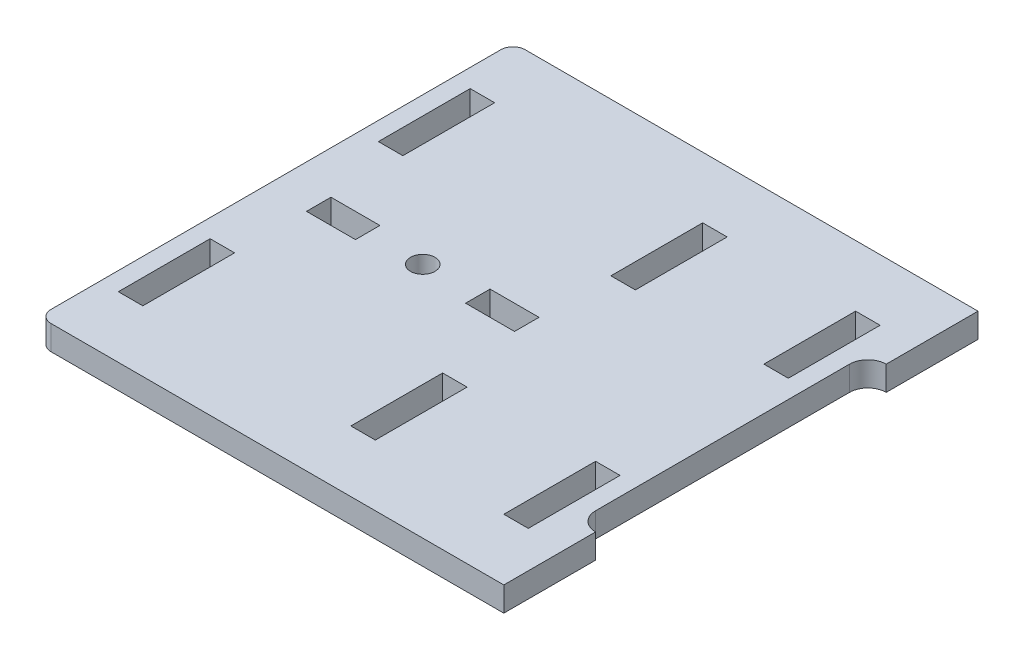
ISO-10303-21;
HEADER;
FILE_DESCRIPTION(('STEP AP214'),'2;1');
FILE_NAME('part.step','',(''),(''),'','','');
FILE_SCHEMA(('AUTOMOTIVE_DESIGN { 1 0 10303 214 1 1 1 1 }'));
ENDSEC;
DATA;
#1=APPLICATION_CONTEXT('core data for automotive mechanical design processes');
#2=APPLICATION_PROTOCOL_DEFINITION('international standard','automotive_design',2000,#1);
#3=PRODUCT_CONTEXT('',#1,'mechanical');
#4=PRODUCT('Part','Part','',(#3));
#5=PRODUCT_RELATED_PRODUCT_CATEGORY('part','',(#4));
#6=PRODUCT_DEFINITION_FORMATION('','',#4);
#7=PRODUCT_DEFINITION_CONTEXT('part definition',#1,'design');
#8=PRODUCT_DEFINITION('design','',#6,#7);
#9=PRODUCT_DEFINITION_SHAPE('','',#8);
#10=(LENGTH_UNIT() NAMED_UNIT(*) SI_UNIT(.MILLI.,.METRE.));
#11=(NAMED_UNIT(*) PLANE_ANGLE_UNIT() SI_UNIT($,.RADIAN.));
#12=(NAMED_UNIT(*) SI_UNIT($,.STERADIAN.) SOLID_ANGLE_UNIT());
#13=UNCERTAINTY_MEASURE_WITH_UNIT(LENGTH_MEASURE(1.E-05),#10,'distance_accuracy_value','');
#14=(GEOMETRIC_REPRESENTATION_CONTEXT(3) GLOBAL_UNCERTAINTY_ASSIGNED_CONTEXT((#13)) GLOBAL_UNIT_ASSIGNED_CONTEXT((#10,
#11,#12)) REPRESENTATION_CONTEXT('',''));
#15=CARTESIAN_POINT('',(0.,0.,0.));
#16=DIRECTION('',(0.,0.,1.));
#17=DIRECTION('',(1.,0.,0.));
#18=AXIS2_PLACEMENT_3D('',#15,#16,#17);
#19=CARTESIAN_POINT('',(38.,4.,20.75));
#20=DIRECTION('',(0.,-1.,0.));
#21=DIRECTION('',(0.,0.,-1.));
#22=AXIS2_PLACEMENT_3D('',#19,#20,#21);
#23=PLANE('',#22);
#24=CARTESIAN_POINT('',(-14.,4.,0.));
#25=DIRECTION('',(0.,1.,0.));
#26=DIRECTION('',(0.,0.,1.));
#27=AXIS2_PLACEMENT_3D('',#24,#25,#26);
#28=CIRCLE('',#27,2.);
#29=CARTESIAN_POINT('',(-14.,4.,2.));
#30=VERTEX_POINT('',#29);
#31=EDGE_CURVE('E338',#30,#30,#28,.T.);
#32=ORIENTED_EDGE('',*,*,#31,.F.);
#33=EDGE_LOOP('',(#32));
#34=FACE_BOUND('',#33,.T.);
#35=DIRECTION('',(1.,0.,0.));
#36=VECTOR('',#35,1.);
#37=CARTESIAN_POINT('',(-35.,4.,28.75));
#38=LINE('',#37,#36);
#39=CARTESIAN_POINT('',(-35.,4.,28.75));
#40=VERTEX_POINT('',#39);
#41=CARTESIAN_POINT('',(-31.,4.,28.75));
#42=VERTEX_POINT('',#41);
#43=EDGE_CURVE('E375',#40,#42,#38,.T.);
#44=ORIENTED_EDGE('',*,*,#43,.F.);
#45=DIRECTION('',(0.,0.,1.));
#46=VECTOR('',#45,1.);
#47=CARTESIAN_POINT('',(-35.,4.,28.75));
#48=LINE('',#47,#46);
#49=CARTESIAN_POINT('',(-35.,4.,13.75));
#50=VERTEX_POINT('',#49);
#51=EDGE_CURVE('E383',#50,#40,#48,.T.);
#52=ORIENTED_EDGE('',*,*,#51,.F.);
#53=DIRECTION('',(-1.,0.,0.));
#54=VECTOR('',#53,1.);
#55=CARTESIAN_POINT('',(-35.,4.,13.75));
#56=LINE('',#55,#54);
#57=CARTESIAN_POINT('',(-31.,4.,13.75));
#58=VERTEX_POINT('',#57);
#59=EDGE_CURVE('E380',#58,#50,#56,.T.);
#60=ORIENTED_EDGE('',*,*,#59,.F.);
#61=DIRECTION('',(0.,0.,-1.));
#62=VECTOR('',#61,1.);
#63=CARTESIAN_POINT('',(-31.,4.,28.75));
#64=LINE('',#63,#62);
#65=EDGE_CURVE('E377',#42,#58,#64,.T.);
#66=ORIENTED_EDGE('',*,*,#65,.F.);
#67=EDGE_LOOP('',(#44,#52,#60,#66));
#68=FACE_BOUND('',#67,.T.);
#69=DIRECTION('',(1.,0.,0.));
#70=VECTOR('',#69,1.);
#71=CARTESIAN_POINT('',(27.9999999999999,4.,28.75));
#72=LINE('',#71,#70);
#73=CARTESIAN_POINT('',(27.9999999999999,4.,28.75));
#74=VERTEX_POINT('',#73);
#75=CARTESIAN_POINT('',(31.9999999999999,4.,28.75));
#76=VERTEX_POINT('',#75);
#77=EDGE_CURVE('E437',#74,#76,#72,.T.);
#78=ORIENTED_EDGE('',*,*,#77,.F.);
#79=DIRECTION('',(0.,0.,1.));
#80=VECTOR('',#79,1.);
#81=CARTESIAN_POINT('',(27.9999999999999,4.,28.75));
#82=LINE('',#81,#80);
#83=CARTESIAN_POINT('',(28.,4.,13.75));
#84=VERTEX_POINT('',#83);
#85=EDGE_CURVE('E445',#84,#74,#82,.T.);
#86=ORIENTED_EDGE('',*,*,#85,.F.);
#87=DIRECTION('',(-1.,0.,0.));
#88=VECTOR('',#87,1.);
#89=CARTESIAN_POINT('',(28.,4.,13.75));
#90=LINE('',#89,#88);
#91=CARTESIAN_POINT('',(32.,4.,13.75));
#92=VERTEX_POINT('',#91);
#93=EDGE_CURVE('E442',#92,#84,#90,.T.);
#94=ORIENTED_EDGE('',*,*,#93,.F.);
#95=DIRECTION('',(0.,0.,-1.));
#96=VECTOR('',#95,1.);
#97=CARTESIAN_POINT('',(31.9999999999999,4.,28.75));
#98=LINE('',#97,#96);
#99=EDGE_CURVE('E439',#76,#92,#98,.T.);
#100=ORIENTED_EDGE('',*,*,#99,.F.);
#101=EDGE_LOOP('',(#78,#86,#94,#100));
#102=FACE_BOUND('',#101,.T.);
#103=DIRECTION('',(0.,0.,1.));
#104=VECTOR('',#103,1.);
#105=CARTESIAN_POINT('',(3.,4.,-28.75));
#106=LINE('',#105,#104);
#107=CARTESIAN_POINT('',(3.,4.,-28.75));
#108=VERTEX_POINT('',#107);
#109=CARTESIAN_POINT('',(3.,4.,-13.75));
#110=VERTEX_POINT('',#109);
#111=EDGE_CURVE('E499',#108,#110,#106,.T.);
#112=ORIENTED_EDGE('',*,*,#111,.F.);
#113=DIRECTION('',(-1.,0.,0.));
#114=VECTOR('',#113,1.);
#115=CARTESIAN_POINT('',(3.,4.,-28.75));
#116=LINE('',#115,#114);
#117=CARTESIAN_POINT('',(7.,4.,-28.75));
#118=VERTEX_POINT('',#117);
#119=EDGE_CURVE('E507',#118,#108,#116,.T.);
#120=ORIENTED_EDGE('',*,*,#119,.F.);
#121=DIRECTION('',(0.,0.,-1.));
#122=VECTOR('',#121,1.);
#123=CARTESIAN_POINT('',(7.,4.,-28.75));
#124=LINE('',#123,#122);
#125=CARTESIAN_POINT('',(7.,4.,-13.75));
#126=VERTEX_POINT('',#125);
#127=EDGE_CURVE('E504',#126,#118,#124,.T.);
#128=ORIENTED_EDGE('',*,*,#127,.F.);
#129=DIRECTION('',(1.,0.,0.));
#130=VECTOR('',#129,1.);
#131=CARTESIAN_POINT('',(3.,4.,-13.75));
#132=LINE('',#131,#130);
#133=EDGE_CURVE('E501',#110,#126,#132,.T.);
#134=ORIENTED_EDGE('',*,*,#133,.F.);
#135=EDGE_LOOP('',(#112,#120,#128,#134));
#136=FACE_BOUND('',#135,.T.);
#137=DIRECTION('',(0.,0.,-1.));
#138=VECTOR('',#137,1.);
#139=CARTESIAN_POINT('',(38.,4.,38.75));
#140=LINE('',#139,#138);
#141=CARTESIAN_POINT('',(38.,4.,38.75));
#142=VERTEX_POINT('',#141);
#143=CARTESIAN_POINT('',(38.,4.,23.75));
#144=VERTEX_POINT('',#143);
#145=EDGE_CURVE('E561',#142,#144,#140,.T.);
#146=ORIENTED_EDGE('',*,*,#145,.T.);
#147=CARTESIAN_POINT('',(38.,4.,20.75));
#148=DIRECTION('',(0.,-1.,0.));
#149=DIRECTION('',(0.,0.,-1.));
#150=AXIS2_PLACEMENT_3D('',#147,#148,#149);
#151=CIRCLE('',#150,3.);
#152=CARTESIAN_POINT('',(35.,4.,20.75));
#153=VERTEX_POINT('',#152);
#154=EDGE_CURVE('E564',#144,#153,#151,.T.);
#155=ORIENTED_EDGE('',*,*,#154,.T.);
#156=DIRECTION('',(0.,0.,-1.));
#157=VECTOR('',#156,1.);
#158=CARTESIAN_POINT('',(35.,4.,-20.75));
#159=LINE('',#158,#157);
#160=CARTESIAN_POINT('',(35.,4.,-20.75));
#161=VERTEX_POINT('',#160);
#162=EDGE_CURVE('E567',#153,#161,#159,.T.);
#163=ORIENTED_EDGE('',*,*,#162,.T.);
#164=CARTESIAN_POINT('',(38.,4.,-20.75));
#165=DIRECTION('',(0.,-1.,0.));
#166=DIRECTION('',(0.,0.,1.));
#167=AXIS2_PLACEMENT_3D('',#164,#165,#166);
#168=CIRCLE('',#167,3.);
#169=CARTESIAN_POINT('',(38.,4.,-23.75));
#170=VERTEX_POINT('',#169);
#171=EDGE_CURVE('E569',#161,#170,#168,.T.);
#172=ORIENTED_EDGE('',*,*,#171,.T.);
#173=DIRECTION('',(0.,0.,-1.));
#174=VECTOR('',#173,1.);
#175=CARTESIAN_POINT('',(38.,4.,-38.75));
#176=LINE('',#175,#174);
#177=CARTESIAN_POINT('',(38.,4.,-38.75));
#178=VERTEX_POINT('',#177);
#179=EDGE_CURVE('E571',#170,#178,#176,.T.);
#180=ORIENTED_EDGE('',*,*,#179,.T.);
#181=DIRECTION('',(-1.,0.,0.));
#182=VECTOR('',#181,1.);
#183=CARTESIAN_POINT('',(-36.,4.,-38.75));
#184=LINE('',#183,#182);
#185=CARTESIAN_POINT('',(-36.,4.,-38.75));
#186=VERTEX_POINT('',#185);
#187=EDGE_CURVE('E573',#178,#186,#184,.T.);
#188=ORIENTED_EDGE('',*,*,#187,.T.);
#189=CARTESIAN_POINT('',(-36.,4.,-36.75));
#190=DIRECTION('',(0.,1.,0.));
#191=DIRECTION('',(0.,0.,-1.));
#192=AXIS2_PLACEMENT_3D('',#189,#190,#191);
#193=CIRCLE('',#192,2.);
#194=CARTESIAN_POINT('',(-38.,4.,-36.75));
#195=VERTEX_POINT('',#194);
#196=EDGE_CURVE('E575',#186,#195,#193,.T.);
#197=ORIENTED_EDGE('',*,*,#196,.T.);
#198=DIRECTION('',(0.,0.,1.));
#199=VECTOR('',#198,1.);
#200=CARTESIAN_POINT('',(-38.,4.,-36.75));
#201=LINE('',#200,#199);
#202=CARTESIAN_POINT('',(-38.,4.,36.75));
#203=VERTEX_POINT('',#202);
#204=EDGE_CURVE('E577',#195,#203,#201,.T.);
#205=ORIENTED_EDGE('',*,*,#204,.T.);
#206=CARTESIAN_POINT('',(-36.,4.,36.75));
#207=DIRECTION('',(0.,1.,0.));
#208=DIRECTION('',(0.,0.,1.));
#209=AXIS2_PLACEMENT_3D('',#206,#207,#208);
#210=CIRCLE('',#209,2.);
#211=CARTESIAN_POINT('',(-36.,4.,38.75));
#212=VERTEX_POINT('',#211);
#213=EDGE_CURVE('E579',#203,#212,#210,.T.);
#214=ORIENTED_EDGE('',*,*,#213,.T.);
#215=DIRECTION('',(1.,0.,0.));
#216=VECTOR('',#215,1.);
#217=CARTESIAN_POINT('',(-36.,4.,38.75));
#218=LINE('',#217,#216);
#219=EDGE_CURVE('E581',#212,#142,#218,.T.);
#220=ORIENTED_EDGE('',*,*,#219,.T.);
#221=EDGE_LOOP('',(#146,#155,#163,#172,#180,#188,#197,#205,#214,#220));
#222=FACE_BOUND('',#221,.T.);
#223=DIRECTION('',(0.,0.,1.));
#224=VECTOR('',#223,1.);
#225=CARTESIAN_POINT('',(-35.,4.,-28.75));
#226=LINE('',#225,#224);
#227=CARTESIAN_POINT('',(-35.,4.,-28.75));
#228=VERTEX_POINT('',#227);
#229=CARTESIAN_POINT('',(-35.,4.,-13.75));
#230=VERTEX_POINT('',#229);
#231=EDGE_CURVE('E530',#228,#230,#226,.T.);
#232=ORIENTED_EDGE('',*,*,#231,.F.);
#233=DIRECTION('',(-1.,0.,0.));
#234=VECTOR('',#233,1.);
#235=CARTESIAN_POINT('',(-35.,4.,-28.75));
#236=LINE('',#235,#234);
#237=CARTESIAN_POINT('',(-31.,4.,-28.75));
#238=VERTEX_POINT('',#237);
#239=EDGE_CURVE('E538',#238,#228,#236,.T.);
#240=ORIENTED_EDGE('',*,*,#239,.F.);
#241=DIRECTION('',(0.,0.,-1.));
#242=VECTOR('',#241,1.);
#243=CARTESIAN_POINT('',(-31.,4.,-28.75));
#244=LINE('',#243,#242);
#245=CARTESIAN_POINT('',(-31.,4.,-13.75));
#246=VERTEX_POINT('',#245);
#247=EDGE_CURVE('E535',#246,#238,#244,.T.);
#248=ORIENTED_EDGE('',*,*,#247,.F.);
#249=DIRECTION('',(1.,0.,0.));
#250=VECTOR('',#249,1.);
#251=CARTESIAN_POINT('',(-35.,4.,-13.75));
#252=LINE('',#251,#250);
#253=EDGE_CURVE('E532',#230,#246,#252,.T.);
#254=ORIENTED_EDGE('',*,*,#253,.F.);
#255=EDGE_LOOP('',(#232,#240,#248,#254));
#256=FACE_BOUND('',#255,.T.);
#257=DIRECTION('',(0.,0.,1.));
#258=VECTOR('',#257,1.);
#259=CARTESIAN_POINT('',(28.,4.,-28.75));
#260=LINE('',#259,#258);
#261=CARTESIAN_POINT('',(28.,4.,-28.75));
#262=VERTEX_POINT('',#261);
#263=CARTESIAN_POINT('',(28.,4.,-13.75));
#264=VERTEX_POINT('',#263);
#265=EDGE_CURVE('E468',#262,#264,#260,.T.);
#266=ORIENTED_EDGE('',*,*,#265,.F.);
#267=DIRECTION('',(-1.,0.,0.));
#268=VECTOR('',#267,1.);
#269=CARTESIAN_POINT('',(28.,4.,-28.75));
#270=LINE('',#269,#268);
#271=CARTESIAN_POINT('',(32.,4.,-28.75));
#272=VERTEX_POINT('',#271);
#273=EDGE_CURVE('E476',#272,#262,#270,.T.);
#274=ORIENTED_EDGE('',*,*,#273,.F.);
#275=DIRECTION('',(0.,0.,-1.));
#276=VECTOR('',#275,1.);
#277=CARTESIAN_POINT('',(32.,4.,-28.75));
#278=LINE('',#277,#276);
#279=CARTESIAN_POINT('',(32.,4.,-13.75));
#280=VERTEX_POINT('',#279);
#281=EDGE_CURVE('E473',#280,#272,#278,.T.);
#282=ORIENTED_EDGE('',*,*,#281,.F.);
#283=DIRECTION('',(1.,0.,0.));
#284=VECTOR('',#283,1.);
#285=CARTESIAN_POINT('',(28.,4.,-13.75));
#286=LINE('',#285,#284);
#287=EDGE_CURVE('E470',#264,#280,#286,.T.);
#288=ORIENTED_EDGE('',*,*,#287,.F.);
#289=EDGE_LOOP('',(#266,#274,#282,#288));
#290=FACE_BOUND('',#289,.T.);
#291=DIRECTION('',(1.,0.,0.));
#292=VECTOR('',#291,1.);
#293=CARTESIAN_POINT('',(2.99999999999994,4.,28.75));
#294=LINE('',#293,#292);
#295=CARTESIAN_POINT('',(2.99999999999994,4.,28.75));
#296=VERTEX_POINT('',#295);
#297=CARTESIAN_POINT('',(6.99999999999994,4.,28.75));
#298=VERTEX_POINT('',#297);
#299=EDGE_CURVE('E406',#296,#298,#294,.T.);
#300=ORIENTED_EDGE('',*,*,#299,.F.);
#301=DIRECTION('',(0.,0.,1.));
#302=VECTOR('',#301,1.);
#303=CARTESIAN_POINT('',(2.99999999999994,4.,28.75));
#304=LINE('',#303,#302);
#305=CARTESIAN_POINT('',(3.,4.,13.75));
#306=VERTEX_POINT('',#305);
#307=EDGE_CURVE('E414',#306,#296,#304,.T.);
#308=ORIENTED_EDGE('',*,*,#307,.F.);
#309=DIRECTION('',(-1.,0.,0.));
#310=VECTOR('',#309,1.);
#311=CARTESIAN_POINT('',(3.,4.,13.75));
#312=LINE('',#311,#310);
#313=CARTESIAN_POINT('',(7.,4.,13.75));
#314=VERTEX_POINT('',#313);
#315=EDGE_CURVE('E411',#314,#306,#312,.T.);
#316=ORIENTED_EDGE('',*,*,#315,.F.);
#317=DIRECTION('',(0.,0.,-1.));
#318=VECTOR('',#317,1.);
#319=CARTESIAN_POINT('',(6.99999999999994,4.,28.75));
#320=LINE('',#319,#318);
#321=EDGE_CURVE('E408',#298,#314,#320,.T.);
#322=ORIENTED_EDGE('',*,*,#321,.F.);
#323=EDGE_LOOP('',(#300,#308,#316,#322));
#324=FACE_BOUND('',#323,.T.);
#325=DIRECTION('',(0.,0.,1.));
#326=VECTOR('',#325,1.);
#327=CARTESIAN_POINT('',(-31.,4.,-2.));
#328=LINE('',#327,#326);
#329=CARTESIAN_POINT('',(-31.,4.,-2.));
#330=VERTEX_POINT('',#329);
#331=CARTESIAN_POINT('',(-31.,4.,2.));
#332=VERTEX_POINT('',#331);
#333=EDGE_CURVE('E344',#330,#332,#328,.T.);
#334=ORIENTED_EDGE('',*,*,#333,.F.);
#335=DIRECTION('',(-1.,0.,0.));
#336=VECTOR('',#335,1.);
#337=CARTESIAN_POINT('',(-31.,4.,-2.));
#338=LINE('',#337,#336);
#339=CARTESIAN_POINT('',(-23.,4.,-2.));
#340=VERTEX_POINT('',#339);
#341=EDGE_CURVE('E352',#340,#330,#338,.T.);
#342=ORIENTED_EDGE('',*,*,#341,.F.);
#343=DIRECTION('',(0.,0.,-1.));
#344=VECTOR('',#343,1.);
#345=CARTESIAN_POINT('',(-23.,4.,-2.));
#346=LINE('',#345,#344);
#347=CARTESIAN_POINT('',(-23.,4.,2.));
#348=VERTEX_POINT('',#347);
#349=EDGE_CURVE('E349',#348,#340,#346,.T.);
#350=ORIENTED_EDGE('',*,*,#349,.F.);
#351=DIRECTION('',(1.,0.,0.));
#352=VECTOR('',#351,1.);
#353=CARTESIAN_POINT('',(-31.,4.,2.));
#354=LINE('',#353,#352);
#355=EDGE_CURVE('E346',#332,#348,#354,.T.);
#356=ORIENTED_EDGE('',*,*,#355,.F.);
#357=EDGE_LOOP('',(#334,#342,#350,#356));
#358=FACE_BOUND('',#357,.T.);
#359=DIRECTION('',(0.,0.,1.));
#360=VECTOR('',#359,1.);
#361=CARTESIAN_POINT('',(-4.99999999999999,4.,-2.));
#362=LINE('',#361,#360);
#363=CARTESIAN_POINT('',(-4.99999999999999,4.,-2.));
#364=VERTEX_POINT('',#363);
#365=CARTESIAN_POINT('',(-4.99999999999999,4.,2.));
#366=VERTEX_POINT('',#365);
#367=EDGE_CURVE('E302',#364,#366,#362,.T.);
#368=ORIENTED_EDGE('',*,*,#367,.F.);
#369=DIRECTION('',(-1.,0.,0.));
#370=VECTOR('',#369,1.);
#371=CARTESIAN_POINT('',(-4.99999999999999,4.,-2.));
#372=LINE('',#371,#370);
#373=CARTESIAN_POINT('',(3.00000000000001,4.,-2.));
#374=VERTEX_POINT('',#373);
#375=EDGE_CURVE('E324',#374,#364,#372,.T.);
#376=ORIENTED_EDGE('',*,*,#375,.F.);
#377=DIRECTION('',(0.,0.,-1.));
#378=VECTOR('',#377,1.);
#379=CARTESIAN_POINT('',(3.00000000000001,4.,-2.));
#380=LINE('',#379,#378);
#381=CARTESIAN_POINT('',(3.00000000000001,4.,2.));
#382=VERTEX_POINT('',#381);
#383=EDGE_CURVE('E322',#382,#374,#380,.T.);
#384=ORIENTED_EDGE('',*,*,#383,.F.);
#385=DIRECTION('',(1.,0.,0.));
#386=VECTOR('',#385,1.);
#387=CARTESIAN_POINT('',(-4.99999999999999,4.,2.));
#388=LINE('',#387,#386);
#389=EDGE_CURVE('E310',#366,#382,#388,.T.);
#390=ORIENTED_EDGE('',*,*,#389,.F.);
#391=EDGE_LOOP('',(#368,#376,#384,#390));
#392=FACE_BOUND('',#391,.T.);
#393=ADVANCED_FACE('F33',(#34,#68,#102,#136,#222,#256,#290,#324,#358,#392),#23,.F.);
#394=CARTESIAN_POINT('',(38.,0.,20.75));
#395=DIRECTION('',(0.,-1.,0.));
#396=DIRECTION('',(0.,0.,-1.));
#397=AXIS2_PLACEMENT_3D('',#394,#395,#396);
#398=PLANE('',#397);
#399=CARTESIAN_POINT('',(-14.,0.,0.));
#400=DIRECTION('',(0.,1.,0.));
#401=DIRECTION('',(0.,0.,1.));
#402=AXIS2_PLACEMENT_3D('',#399,#400,#401);
#403=CIRCLE('',#402,2.);
#404=CARTESIAN_POINT('',(-14.,0.,2.));
#405=VERTEX_POINT('',#404);
#406=EDGE_CURVE('E318',#405,#405,#403,.T.);
#407=ORIENTED_EDGE('',*,*,#406,.T.);
#408=EDGE_LOOP('',(#407));
#409=FACE_BOUND('',#408,.T.);
#410=DIRECTION('',(0.,0.,1.));
#411=VECTOR('',#410,1.);
#412=CARTESIAN_POINT('',(-35.,0.,28.75));
#413=LINE('',#412,#411);
#414=CARTESIAN_POINT('',(-35.,0.,13.75));
#415=VERTEX_POINT('',#414);
#416=CARTESIAN_POINT('',(-35.,0.,28.75));
#417=VERTEX_POINT('',#416);
#418=EDGE_CURVE('E378',#415,#417,#413,.T.);
#419=ORIENTED_EDGE('',*,*,#418,.T.);
#420=DIRECTION('',(1.,0.,0.));
#421=VECTOR('',#420,1.);
#422=CARTESIAN_POINT('',(-35.,0.,28.75));
#423=LINE('',#422,#421);
#424=CARTESIAN_POINT('',(-31.,0.,28.75));
#425=VERTEX_POINT('',#424);
#426=EDGE_CURVE('E374',#417,#425,#423,.T.);
#427=ORIENTED_EDGE('',*,*,#426,.T.);
#428=DIRECTION('',(0.,0.,-1.));
#429=VECTOR('',#428,1.);
#430=CARTESIAN_POINT('',(-31.,0.,28.75));
#431=LINE('',#430,#429);
#432=CARTESIAN_POINT('',(-31.,0.,13.75));
#433=VERTEX_POINT('',#432);
#434=EDGE_CURVE('E388',#425,#433,#431,.T.);
#435=ORIENTED_EDGE('',*,*,#434,.T.);
#436=DIRECTION('',(-1.,0.,0.));
#437=VECTOR('',#436,1.);
#438=CARTESIAN_POINT('',(-35.,0.,13.75));
#439=LINE('',#438,#437);
#440=EDGE_CURVE('E391',#433,#415,#439,.T.);
#441=ORIENTED_EDGE('',*,*,#440,.T.);
#442=EDGE_LOOP('',(#419,#427,#435,#441));
#443=FACE_BOUND('',#442,.T.);
#444=DIRECTION('',(0.,0.,1.));
#445=VECTOR('',#444,1.);
#446=CARTESIAN_POINT('',(27.9999999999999,0.,28.75));
#447=LINE('',#446,#445);
#448=CARTESIAN_POINT('',(28.,0.,13.75));
#449=VERTEX_POINT('',#448);
#450=CARTESIAN_POINT('',(27.9999999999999,0.,28.75));
#451=VERTEX_POINT('',#450);
#452=EDGE_CURVE('E440',#449,#451,#447,.T.);
#453=ORIENTED_EDGE('',*,*,#452,.T.);
#454=DIRECTION('',(1.,0.,0.));
#455=VECTOR('',#454,1.);
#456=CARTESIAN_POINT('',(27.9999999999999,0.,28.75));
#457=LINE('',#456,#455);
#458=CARTESIAN_POINT('',(31.9999999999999,0.,28.75));
#459=VERTEX_POINT('',#458);
#460=EDGE_CURVE('E436',#451,#459,#457,.T.);
#461=ORIENTED_EDGE('',*,*,#460,.T.);
#462=DIRECTION('',(0.,0.,-1.));
#463=VECTOR('',#462,1.);
#464=CARTESIAN_POINT('',(31.9999999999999,0.,28.75));
#465=LINE('',#464,#463);
#466=CARTESIAN_POINT('',(32.,0.,13.75));
#467=VERTEX_POINT('',#466);
#468=EDGE_CURVE('E450',#459,#467,#465,.T.);
#469=ORIENTED_EDGE('',*,*,#468,.T.);
#470=DIRECTION('',(-1.,0.,0.));
#471=VECTOR('',#470,1.);
#472=CARTESIAN_POINT('',(28.,0.,13.75));
#473=LINE('',#472,#471);
#474=EDGE_CURVE('E453',#467,#449,#473,.T.);
#475=ORIENTED_EDGE('',*,*,#474,.T.);
#476=EDGE_LOOP('',(#453,#461,#469,#475));
#477=FACE_BOUND('',#476,.T.);
#478=DIRECTION('',(-1.,0.,0.));
#479=VECTOR('',#478,1.);
#480=CARTESIAN_POINT('',(3.,0.,-28.75));
#481=LINE('',#480,#479);
#482=CARTESIAN_POINT('',(7.,0.,-28.75));
#483=VERTEX_POINT('',#482);
#484=CARTESIAN_POINT('',(3.,0.,-28.75));
#485=VERTEX_POINT('',#484);
#486=EDGE_CURVE('E502',#483,#485,#481,.T.);
#487=ORIENTED_EDGE('',*,*,#486,.T.);
#488=DIRECTION('',(0.,0.,1.));
#489=VECTOR('',#488,1.);
#490=CARTESIAN_POINT('',(3.,0.,-28.75));
#491=LINE('',#490,#489);
#492=CARTESIAN_POINT('',(3.,0.,-13.75));
#493=VERTEX_POINT('',#492);
#494=EDGE_CURVE('E498',#485,#493,#491,.T.);
#495=ORIENTED_EDGE('',*,*,#494,.T.);
#496=DIRECTION('',(1.,0.,0.));
#497=VECTOR('',#496,1.);
#498=CARTESIAN_POINT('',(3.,0.,-13.75));
#499=LINE('',#498,#497);
#500=CARTESIAN_POINT('',(7.,0.,-13.75));
#501=VERTEX_POINT('',#500);
#502=EDGE_CURVE('E512',#493,#501,#499,.T.);
#503=ORIENTED_EDGE('',*,*,#502,.T.);
#504=DIRECTION('',(0.,0.,-1.));
#505=VECTOR('',#504,1.);
#506=CARTESIAN_POINT('',(7.,0.,-28.75));
#507=LINE('',#506,#505);
#508=EDGE_CURVE('E515',#501,#483,#507,.T.);
#509=ORIENTED_EDGE('',*,*,#508,.T.);
#510=EDGE_LOOP('',(#487,#495,#503,#509));
#511=FACE_BOUND('',#510,.T.);
#512=DIRECTION('',(0.,0.,-1.));
#513=VECTOR('',#512,1.);
#514=CARTESIAN_POINT('',(38.,0.,38.75));
#515=LINE('',#514,#513);
#516=CARTESIAN_POINT('',(38.,0.,38.75));
#517=VERTEX_POINT('',#516);
#518=CARTESIAN_POINT('',(38.,0.,23.75));
#519=VERTEX_POINT('',#518);
#520=EDGE_CURVE('E560',#517,#519,#515,.T.);
#521=ORIENTED_EDGE('',*,*,#520,.F.);
#522=DIRECTION('',(1.,0.,0.));
#523=VECTOR('',#522,1.);
#524=CARTESIAN_POINT('',(-36.,0.,38.75));
#525=LINE('',#524,#523);
#526=CARTESIAN_POINT('',(-36.,0.,38.75));
#527=VERTEX_POINT('',#526);
#528=EDGE_CURVE('E565',#527,#517,#525,.T.);
#529=ORIENTED_EDGE('',*,*,#528,.F.);
#530=CARTESIAN_POINT('',(-36.,0.,36.75));
#531=DIRECTION('',(0.,1.,0.));
#532=DIRECTION('',(0.,0.,1.));
#533=AXIS2_PLACEMENT_3D('',#530,#531,#532);
#534=CIRCLE('',#533,2.);
#535=CARTESIAN_POINT('',(-38.,0.,36.75));
#536=VERTEX_POINT('',#535);
#537=EDGE_CURVE('E600',#536,#527,#534,.T.);
#538=ORIENTED_EDGE('',*,*,#537,.F.);
#539=DIRECTION('',(0.,0.,1.));
#540=VECTOR('',#539,1.);
#541=CARTESIAN_POINT('',(-38.,0.,-36.75));
#542=LINE('',#541,#540);
#543=CARTESIAN_POINT('',(-38.,0.,-36.75));
#544=VERTEX_POINT('',#543);
#545=EDGE_CURVE('E598',#544,#536,#542,.T.);
#546=ORIENTED_EDGE('',*,*,#545,.F.);
#547=CARTESIAN_POINT('',(-36.,0.,-36.75));
#548=DIRECTION('',(0.,1.,0.));
#549=DIRECTION('',(0.,0.,-1.));
#550=AXIS2_PLACEMENT_3D('',#547,#548,#549);
#551=CIRCLE('',#550,2.);
#552=CARTESIAN_POINT('',(-36.,0.,-38.75));
#553=VERTEX_POINT('',#552);
#554=EDGE_CURVE('E596',#553,#544,#551,.T.);
#555=ORIENTED_EDGE('',*,*,#554,.F.);
#556=DIRECTION('',(-1.,0.,0.));
#557=VECTOR('',#556,1.);
#558=CARTESIAN_POINT('',(-36.,0.,-38.75));
#559=LINE('',#558,#557);
#560=CARTESIAN_POINT('',(38.,0.,-38.75));
#561=VERTEX_POINT('',#560);
#562=EDGE_CURVE('E594',#561,#553,#559,.T.);
#563=ORIENTED_EDGE('',*,*,#562,.F.);
#564=DIRECTION('',(0.,0.,-1.));
#565=VECTOR('',#564,1.);
#566=CARTESIAN_POINT('',(38.,0.,-38.75));
#567=LINE('',#566,#565);
#568=CARTESIAN_POINT('',(38.,0.,-23.75));
#569=VERTEX_POINT('',#568);
#570=EDGE_CURVE('E592',#569,#561,#567,.T.);
#571=ORIENTED_EDGE('',*,*,#570,.F.);
#572=CARTESIAN_POINT('',(38.,0.,-20.75));
#573=DIRECTION('',(0.,-1.,0.));
#574=DIRECTION('',(0.,0.,1.));
#575=AXIS2_PLACEMENT_3D('',#572,#573,#574);
#576=CIRCLE('',#575,3.);
#577=CARTESIAN_POINT('',(35.,0.,-20.75));
#578=VERTEX_POINT('',#577);
#579=EDGE_CURVE('E590',#578,#569,#576,.T.);
#580=ORIENTED_EDGE('',*,*,#579,.F.);
#581=DIRECTION('',(0.,0.,-1.));
#582=VECTOR('',#581,1.);
#583=CARTESIAN_POINT('',(35.,0.,-20.75));
#584=LINE('',#583,#582);
#585=CARTESIAN_POINT('',(35.,0.,20.75));
#586=VERTEX_POINT('',#585);
#587=EDGE_CURVE('E588',#586,#578,#584,.T.);
#588=ORIENTED_EDGE('',*,*,#587,.F.);
#589=CARTESIAN_POINT('',(38.,0.,20.75));
#590=DIRECTION('',(0.,-1.,0.));
#591=DIRECTION('',(0.,0.,-1.));
#592=AXIS2_PLACEMENT_3D('',#589,#590,#591);
#593=CIRCLE('',#592,3.);
#594=EDGE_CURVE('E586',#519,#586,#593,.T.);
#595=ORIENTED_EDGE('',*,*,#594,.F.);
#596=EDGE_LOOP('',(#521,#529,#538,#546,#555,#563,#571,#580,#588,#595));
#597=FACE_BOUND('',#596,.T.);
#598=DIRECTION('',(-1.,0.,0.));
#599=VECTOR('',#598,1.);
#600=CARTESIAN_POINT('',(-35.,0.,-28.75));
#601=LINE('',#600,#599);
#602=CARTESIAN_POINT('',(-31.,0.,-28.75));
#603=VERTEX_POINT('',#602);
#604=CARTESIAN_POINT('',(-35.,0.,-28.75));
#605=VERTEX_POINT('',#604);
#606=EDGE_CURVE('E533',#603,#605,#601,.T.);
#607=ORIENTED_EDGE('',*,*,#606,.T.);
#608=DIRECTION('',(0.,0.,1.));
#609=VECTOR('',#608,1.);
#610=CARTESIAN_POINT('',(-35.,0.,-28.75));
#611=LINE('',#610,#609);
#612=CARTESIAN_POINT('',(-35.,0.,-13.75));
#613=VERTEX_POINT('',#612);
#614=EDGE_CURVE('E529',#605,#613,#611,.T.);
#615=ORIENTED_EDGE('',*,*,#614,.T.);
#616=DIRECTION('',(1.,0.,0.));
#617=VECTOR('',#616,1.);
#618=CARTESIAN_POINT('',(-35.,0.,-13.75));
#619=LINE('',#618,#617);
#620=CARTESIAN_POINT('',(-31.,0.,-13.75));
#621=VERTEX_POINT('',#620);
#622=EDGE_CURVE('E543',#613,#621,#619,.T.);
#623=ORIENTED_EDGE('',*,*,#622,.T.);
#624=DIRECTION('',(0.,0.,-1.));
#625=VECTOR('',#624,1.);
#626=CARTESIAN_POINT('',(-31.,0.,-28.75));
#627=LINE('',#626,#625);
#628=EDGE_CURVE('E546',#621,#603,#627,.T.);
#629=ORIENTED_EDGE('',*,*,#628,.T.);
#630=EDGE_LOOP('',(#607,#615,#623,#629));
#631=FACE_BOUND('',#630,.T.);
#632=DIRECTION('',(-1.,0.,0.));
#633=VECTOR('',#632,1.);
#634=CARTESIAN_POINT('',(28.,0.,-28.75));
#635=LINE('',#634,#633);
#636=CARTESIAN_POINT('',(32.,0.,-28.75));
#637=VERTEX_POINT('',#636);
#638=CARTESIAN_POINT('',(28.,0.,-28.75));
#639=VERTEX_POINT('',#638);
#640=EDGE_CURVE('E471',#637,#639,#635,.T.);
#641=ORIENTED_EDGE('',*,*,#640,.T.);
#642=DIRECTION('',(0.,0.,1.));
#643=VECTOR('',#642,1.);
#644=CARTESIAN_POINT('',(28.,0.,-28.75));
#645=LINE('',#644,#643);
#646=CARTESIAN_POINT('',(28.,0.,-13.75));
#647=VERTEX_POINT('',#646);
#648=EDGE_CURVE('E467',#639,#647,#645,.T.);
#649=ORIENTED_EDGE('',*,*,#648,.T.);
#650=DIRECTION('',(1.,0.,0.));
#651=VECTOR('',#650,1.);
#652=CARTESIAN_POINT('',(28.,0.,-13.75));
#653=LINE('',#652,#651);
#654=CARTESIAN_POINT('',(32.,0.,-13.75));
#655=VERTEX_POINT('',#654);
#656=EDGE_CURVE('E481',#647,#655,#653,.T.);
#657=ORIENTED_EDGE('',*,*,#656,.T.);
#658=DIRECTION('',(0.,0.,-1.));
#659=VECTOR('',#658,1.);
#660=CARTESIAN_POINT('',(32.,0.,-28.75));
#661=LINE('',#660,#659);
#662=EDGE_CURVE('E484',#655,#637,#661,.T.);
#663=ORIENTED_EDGE('',*,*,#662,.T.);
#664=EDGE_LOOP('',(#641,#649,#657,#663));
#665=FACE_BOUND('',#664,.T.);
#666=DIRECTION('',(0.,0.,1.));
#667=VECTOR('',#666,1.);
#668=CARTESIAN_POINT('',(2.99999999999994,0.,28.75));
#669=LINE('',#668,#667);
#670=CARTESIAN_POINT('',(3.,0.,13.75));
#671=VERTEX_POINT('',#670);
#672=CARTESIAN_POINT('',(2.99999999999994,0.,28.75));
#673=VERTEX_POINT('',#672);
#674=EDGE_CURVE('E409',#671,#673,#669,.T.);
#675=ORIENTED_EDGE('',*,*,#674,.T.);
#676=DIRECTION('',(1.,0.,0.));
#677=VECTOR('',#676,1.);
#678=CARTESIAN_POINT('',(2.99999999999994,0.,28.75));
#679=LINE('',#678,#677);
#680=CARTESIAN_POINT('',(6.99999999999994,0.,28.75));
#681=VERTEX_POINT('',#680);
#682=EDGE_CURVE('E405',#673,#681,#679,.T.);
#683=ORIENTED_EDGE('',*,*,#682,.T.);
#684=DIRECTION('',(0.,0.,-1.));
#685=VECTOR('',#684,1.);
#686=CARTESIAN_POINT('',(6.99999999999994,0.,28.75));
#687=LINE('',#686,#685);
#688=CARTESIAN_POINT('',(7.,0.,13.75));
#689=VERTEX_POINT('',#688);
#690=EDGE_CURVE('E419',#681,#689,#687,.T.);
#691=ORIENTED_EDGE('',*,*,#690,.T.);
#692=DIRECTION('',(-1.,0.,0.));
#693=VECTOR('',#692,1.);
#694=CARTESIAN_POINT('',(3.,0.,13.75));
#695=LINE('',#694,#693);
#696=EDGE_CURVE('E422',#689,#671,#695,.T.);
#697=ORIENTED_EDGE('',*,*,#696,.T.);
#698=EDGE_LOOP('',(#675,#683,#691,#697));
#699=FACE_BOUND('',#698,.T.);
#700=DIRECTION('',(-1.,0.,0.));
#701=VECTOR('',#700,1.);
#702=CARTESIAN_POINT('',(-31.,0.,-2.));
#703=LINE('',#702,#701);
#704=CARTESIAN_POINT('',(-23.,0.,-2.));
#705=VERTEX_POINT('',#704);
#706=CARTESIAN_POINT('',(-31.,0.,-2.));
#707=VERTEX_POINT('',#706);
#708=EDGE_CURVE('E347',#705,#707,#703,.T.);
#709=ORIENTED_EDGE('',*,*,#708,.T.);
#710=DIRECTION('',(0.,0.,1.));
#711=VECTOR('',#710,1.);
#712=CARTESIAN_POINT('',(-31.,0.,-2.));
#713=LINE('',#712,#711);
#714=CARTESIAN_POINT('',(-31.,0.,2.));
#715=VERTEX_POINT('',#714);
#716=EDGE_CURVE('E341',#707,#715,#713,.T.);
#717=ORIENTED_EDGE('',*,*,#716,.T.);
#718=DIRECTION('',(1.,0.,0.));
#719=VECTOR('',#718,1.);
#720=CARTESIAN_POINT('',(-31.,0.,2.));
#721=LINE('',#720,#719);
#722=CARTESIAN_POINT('',(-23.,0.,2.));
#723=VERTEX_POINT('',#722);
#724=EDGE_CURVE('E357',#715,#723,#721,.T.);
#725=ORIENTED_EDGE('',*,*,#724,.T.);
#726=DIRECTION('',(0.,0.,-1.));
#727=VECTOR('',#726,1.);
#728=CARTESIAN_POINT('',(-23.,0.,-2.));
#729=LINE('',#728,#727);
#730=EDGE_CURVE('E360',#723,#705,#729,.T.);
#731=ORIENTED_EDGE('',*,*,#730,.T.);
#732=EDGE_LOOP('',(#709,#717,#725,#731));
#733=FACE_BOUND('',#732,.T.);
#734=DIRECTION('',(-1.,0.,0.));
#735=VECTOR('',#734,1.);
#736=CARTESIAN_POINT('',(-4.99999999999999,0.,-2.));
#737=LINE('',#736,#735);
#738=CARTESIAN_POINT('',(3.00000000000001,0.,-2.));
#739=VERTEX_POINT('',#738);
#740=CARTESIAN_POINT('',(-4.99999999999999,0.,-2.));
#741=VERTEX_POINT('',#740);
#742=EDGE_CURVE('E311',#739,#741,#737,.T.);
#743=ORIENTED_EDGE('',*,*,#742,.T.);
#744=DIRECTION('',(0.,0.,1.));
#745=VECTOR('',#744,1.);
#746=CARTESIAN_POINT('',(-4.99999999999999,0.,-2.));
#747=LINE('',#746,#745);
#748=CARTESIAN_POINT('',(-4.99999999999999,0.,2.));
#749=VERTEX_POINT('',#748);
#750=EDGE_CURVE('E56',#741,#749,#747,.T.);
#751=ORIENTED_EDGE('',*,*,#750,.T.);
#752=DIRECTION('',(1.,0.,0.));
#753=VECTOR('',#752,1.);
#754=CARTESIAN_POINT('',(-4.99999999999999,0.,2.));
#755=LINE('',#754,#753);
#756=CARTESIAN_POINT('',(3.00000000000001,0.,2.));
#757=VERTEX_POINT('',#756);
#758=EDGE_CURVE('E317',#749,#757,#755,.T.);
#759=ORIENTED_EDGE('',*,*,#758,.T.);
#760=DIRECTION('',(0.,0.,-1.));
#761=VECTOR('',#760,1.);
#762=CARTESIAN_POINT('',(3.00000000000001,0.,-2.));
#763=LINE('',#762,#761);
#764=EDGE_CURVE('E330',#757,#739,#763,.T.);
#765=ORIENTED_EDGE('',*,*,#764,.T.);
#766=EDGE_LOOP('',(#743,#751,#759,#765));
#767=FACE_BOUND('',#766,.T.);
#768=ADVANCED_FACE('F636',(#409,#443,#477,#511,#597,#631,#665,#699,#733,#767),#398,.T.);
#769=CARTESIAN_POINT('',(38.,4.,38.75));
#770=DIRECTION('',(-1.,0.,0.));
#771=DIRECTION('',(0.,0.,1.));
#772=AXIS2_PLACEMENT_3D('',#769,#770,#771);
#773=PLANE('',#772);
#774=ORIENTED_EDGE('',*,*,#520,.T.);
#775=DIRECTION('',(0.,-1.,0.));
#776=VECTOR('',#775,1.);
#777=CARTESIAN_POINT('',(38.,4.,23.75));
#778=LINE('',#777,#776);
#779=EDGE_CURVE('E11',#144,#519,#778,.T.);
#780=ORIENTED_EDGE('',*,*,#779,.F.);
#781=ORIENTED_EDGE('',*,*,#145,.F.);
#782=DIRECTION('',(0.,-1.,0.));
#783=VECTOR('',#782,1.);
#784=CARTESIAN_POINT('',(38.,4.,38.75));
#785=LINE('',#784,#783);
#786=EDGE_CURVE('E583',#142,#517,#785,.T.);
#787=ORIENTED_EDGE('',*,*,#786,.T.);
#788=EDGE_LOOP('',(#774,#780,#781,#787));
#789=FACE_BOUND('',#788,.T.);
#790=ADVANCED_FACE('F35',(#789),#773,.F.);
#791=CARTESIAN_POINT('',(38.,4.,20.75));
#792=DIRECTION('',(0.,-1.,0.));
#793=DIRECTION('',(0.,0.,-1.));
#794=AXIS2_PLACEMENT_3D('',#791,#792,#793);
#795=CYLINDRICAL_SURFACE('',#794,3.);
#796=ORIENTED_EDGE('',*,*,#594,.T.);
#797=DIRECTION('',(0.,-1.,0.));
#798=VECTOR('',#797,1.);
#799=CARTESIAN_POINT('',(35.,4.,20.75));
#800=LINE('',#799,#798);
#801=EDGE_CURVE('E41',#153,#586,#800,.T.);
#802=ORIENTED_EDGE('',*,*,#801,.F.);
#803=ORIENTED_EDGE('',*,*,#154,.F.);
#804=ORIENTED_EDGE('',*,*,#779,.T.);
#805=EDGE_LOOP('',(#796,#802,#803,#804));
#806=FACE_BOUND('',#805,.T.);
#807=ADVANCED_FACE('F654',(#806),#795,.F.);
#808=CARTESIAN_POINT('',(35.,4.,-20.75));
#809=DIRECTION('',(-1.,0.,0.));
#810=DIRECTION('',(0.,0.,1.));
#811=AXIS2_PLACEMENT_3D('',#808,#809,#810);
#812=PLANE('',#811);
#813=ORIENTED_EDGE('',*,*,#587,.T.);
#814=DIRECTION('',(0.,-1.,0.));
#815=VECTOR('',#814,1.);
#816=CARTESIAN_POINT('',(35.,4.,-20.75));
#817=LINE('',#816,#815);
#818=EDGE_CURVE('E623',#161,#578,#817,.T.);
#819=ORIENTED_EDGE('',*,*,#818,.F.);
#820=ORIENTED_EDGE('',*,*,#162,.F.);
#821=ORIENTED_EDGE('',*,*,#801,.T.);
#822=EDGE_LOOP('',(#813,#819,#820,#821));
#823=FACE_BOUND('',#822,.T.);
#824=ADVANCED_FACE('F630',(#823),#812,.F.);
#825=CARTESIAN_POINT('',(38.,4.,-20.75));
#826=DIRECTION('',(0.,-1.,0.));
#827=DIRECTION('',(0.,0.,-1.));
#828=AXIS2_PLACEMENT_3D('',#825,#826,#827);
#829=CYLINDRICAL_SURFACE('',#828,3.);
#830=ORIENTED_EDGE('',*,*,#579,.T.);
#831=DIRECTION('',(0.,-1.,0.));
#832=VECTOR('',#831,1.);
#833=CARTESIAN_POINT('',(38.,4.,-23.75));
#834=LINE('',#833,#832);
#835=EDGE_CURVE('E620',#170,#569,#834,.T.);
#836=ORIENTED_EDGE('',*,*,#835,.F.);
#837=ORIENTED_EDGE('',*,*,#171,.F.);
#838=ORIENTED_EDGE('',*,*,#818,.T.);
#839=EDGE_LOOP('',(#830,#836,#837,#838));
#840=FACE_BOUND('',#839,.T.);
#841=ADVANCED_FACE('F642',(#840),#829,.F.);
#842=CARTESIAN_POINT('',(38.,4.,-38.75));
#843=DIRECTION('',(-1.,0.,0.));
#844=DIRECTION('',(0.,0.,1.));
#845=AXIS2_PLACEMENT_3D('',#842,#843,#844);
#846=PLANE('',#845);
#847=ORIENTED_EDGE('',*,*,#570,.T.);
#848=DIRECTION('',(0.,-1.,0.));
#849=VECTOR('',#848,1.);
#850=CARTESIAN_POINT('',(38.,4.,-38.75));
#851=LINE('',#850,#849);
#852=EDGE_CURVE('E617',#178,#561,#851,.T.);
#853=ORIENTED_EDGE('',*,*,#852,.F.);
#854=ORIENTED_EDGE('',*,*,#179,.F.);
#855=ORIENTED_EDGE('',*,*,#835,.T.);
#856=EDGE_LOOP('',(#847,#853,#854,#855));
#857=FACE_BOUND('',#856,.T.);
#858=ADVANCED_FACE('F646',(#857),#846,.F.);
#859=CARTESIAN_POINT('',(-36.,4.,-38.75));
#860=DIRECTION('',(0.,0.,1.));
#861=DIRECTION('',(1.,0.,0.));
#862=AXIS2_PLACEMENT_3D('',#859,#860,#861);
#863=PLANE('',#862);
#864=ORIENTED_EDGE('',*,*,#562,.T.);
#865=DIRECTION('',(0.,-1.,0.));
#866=VECTOR('',#865,1.);
#867=CARTESIAN_POINT('',(-36.,4.,-38.75));
#868=LINE('',#867,#866);
#869=EDGE_CURVE('E614',#186,#553,#868,.T.);
#870=ORIENTED_EDGE('',*,*,#869,.F.);
#871=ORIENTED_EDGE('',*,*,#187,.F.);
#872=ORIENTED_EDGE('',*,*,#852,.T.);
#873=EDGE_LOOP('',(#864,#870,#871,#872));
#874=FACE_BOUND('',#873,.T.);
#875=ADVANCED_FACE('F677',(#874),#863,.F.);
#876=CARTESIAN_POINT('',(-36.,4.,-36.75));
#877=DIRECTION('',(0.,-1.,0.));
#878=DIRECTION('',(0.,0.,-1.));
#879=AXIS2_PLACEMENT_3D('',#876,#877,#878);
#880=CYLINDRICAL_SURFACE('',#879,2.);
#881=ORIENTED_EDGE('',*,*,#554,.T.);
#882=DIRECTION('',(0.,-1.,0.));
#883=VECTOR('',#882,1.);
#884=CARTESIAN_POINT('',(-38.,4.,-36.75));
#885=LINE('',#884,#883);
#886=EDGE_CURVE('E611',#195,#544,#885,.T.);
#887=ORIENTED_EDGE('',*,*,#886,.F.);
#888=ORIENTED_EDGE('',*,*,#196,.F.);
#889=ORIENTED_EDGE('',*,*,#869,.T.);
#890=EDGE_LOOP('',(#881,#887,#888,#889));
#891=FACE_BOUND('',#890,.T.);
#892=ADVANCED_FACE('F674',(#891),#880,.T.);
#893=CARTESIAN_POINT('',(-38.,4.,-36.75));
#894=DIRECTION('',(1.,0.,0.));
#895=DIRECTION('',(0.,0.,-1.));
#896=AXIS2_PLACEMENT_3D('',#893,#894,#895);
#897=PLANE('',#896);
#898=ORIENTED_EDGE('',*,*,#545,.T.);
#899=DIRECTION('',(0.,-1.,0.));
#900=VECTOR('',#899,1.);
#901=CARTESIAN_POINT('',(-38.,4.,36.75));
#902=LINE('',#901,#900);
#903=EDGE_CURVE('E608',#203,#536,#902,.T.);
#904=ORIENTED_EDGE('',*,*,#903,.F.);
#905=ORIENTED_EDGE('',*,*,#204,.F.);
#906=ORIENTED_EDGE('',*,*,#886,.T.);
#907=EDGE_LOOP('',(#898,#904,#905,#906));
#908=FACE_BOUND('',#907,.T.);
#909=ADVANCED_FACE('F670',(#908),#897,.F.);
#910=CARTESIAN_POINT('',(-36.,4.,36.75));
#911=DIRECTION('',(0.,-1.,0.));
#912=DIRECTION('',(0.,0.,-1.));
#913=AXIS2_PLACEMENT_3D('',#910,#911,#912);
#914=CYLINDRICAL_SURFACE('',#913,2.);
#915=ORIENTED_EDGE('',*,*,#537,.T.);
#916=DIRECTION('',(0.,-1.,0.));
#917=VECTOR('',#916,1.);
#918=CARTESIAN_POINT('',(-36.,4.,38.75));
#919=LINE('',#918,#917);
#920=EDGE_CURVE('E605',#212,#527,#919,.T.);
#921=ORIENTED_EDGE('',*,*,#920,.F.);
#922=ORIENTED_EDGE('',*,*,#213,.F.);
#923=ORIENTED_EDGE('',*,*,#903,.T.);
#924=EDGE_LOOP('',(#915,#921,#922,#923));
#925=FACE_BOUND('',#924,.T.);
#926=ADVANCED_FACE('F666',(#925),#914,.T.);
#927=CARTESIAN_POINT('',(-36.,4.,38.75));
#928=DIRECTION('',(0.,0.,-1.));
#929=DIRECTION('',(-1.,0.,0.));
#930=AXIS2_PLACEMENT_3D('',#927,#928,#929);
#931=PLANE('',#930);
#932=ORIENTED_EDGE('',*,*,#528,.T.);
#933=ORIENTED_EDGE('',*,*,#786,.F.);
#934=ORIENTED_EDGE('',*,*,#219,.F.);
#935=ORIENTED_EDGE('',*,*,#920,.T.);
#936=EDGE_LOOP('',(#932,#933,#934,#935));
#937=FACE_BOUND('',#936,.T.);
#938=ADVANCED_FACE('F661',(#937),#931,.F.);
#939=CARTESIAN_POINT('',(-35.,4.,-28.75));
#940=DIRECTION('',(1.,0.,0.));
#941=DIRECTION('',(0.,0.,-1.));
#942=AXIS2_PLACEMENT_3D('',#939,#940,#941);
#943=PLANE('',#942);
#944=ORIENTED_EDGE('',*,*,#614,.F.);
#945=DIRECTION('',(0.,-1.,0.));
#946=VECTOR('',#945,1.);
#947=CARTESIAN_POINT('',(-35.,4.,-28.75));
#948=LINE('',#947,#946);
#949=EDGE_CURVE('E540',#228,#605,#948,.T.);
#950=ORIENTED_EDGE('',*,*,#949,.F.);
#951=ORIENTED_EDGE('',*,*,#231,.T.);
#952=DIRECTION('',(0.,-1.,0.));
#953=VECTOR('',#952,1.);
#954=CARTESIAN_POINT('',(-35.,4.,-13.75));
#955=LINE('',#954,#953);
#956=EDGE_CURVE('E557',#230,#613,#955,.T.);
#957=ORIENTED_EDGE('',*,*,#956,.T.);
#958=EDGE_LOOP('',(#944,#950,#951,#957));
#959=FACE_BOUND('',#958,.T.);
#960=ADVANCED_FACE('F697',(#959),#943,.T.);
#961=CARTESIAN_POINT('',(-35.,4.,-13.75));
#962=DIRECTION('',(0.,0.,-1.));
#963=DIRECTION('',(-1.,0.,0.));
#964=AXIS2_PLACEMENT_3D('',#961,#962,#963);
#965=PLANE('',#964);
#966=ORIENTED_EDGE('',*,*,#622,.F.);
#967=ORIENTED_EDGE('',*,*,#956,.F.);
#968=ORIENTED_EDGE('',*,*,#253,.T.);
#969=DIRECTION('',(0.,-1.,0.));
#970=VECTOR('',#969,1.);
#971=CARTESIAN_POINT('',(-31.,4.,-13.75));
#972=LINE('',#971,#970);
#973=EDGE_CURVE('E555',#246,#621,#972,.T.);
#974=ORIENTED_EDGE('',*,*,#973,.T.);
#975=EDGE_LOOP('',(#966,#967,#968,#974));
#976=FACE_BOUND('',#975,.T.);
#977=ADVANCED_FACE('F723',(#976),#965,.T.);
#978=CARTESIAN_POINT('',(-31.,4.,-28.75));
#979=DIRECTION('',(-1.,0.,0.));
#980=DIRECTION('',(0.,0.,1.));
#981=AXIS2_PLACEMENT_3D('',#978,#979,#980);
#982=PLANE('',#981);
#983=ORIENTED_EDGE('',*,*,#628,.F.);
#984=ORIENTED_EDGE('',*,*,#973,.F.);
#985=ORIENTED_EDGE('',*,*,#247,.T.);
#986=DIRECTION('',(0.,-1.,0.));
#987=VECTOR('',#986,1.);
#988=CARTESIAN_POINT('',(-31.,4.,-28.75));
#989=LINE('',#988,#987);
#990=EDGE_CURVE('E553',#238,#603,#989,.T.);
#991=ORIENTED_EDGE('',*,*,#990,.T.);
#992=EDGE_LOOP('',(#983,#984,#985,#991));
#993=FACE_BOUND('',#992,.T.);
#994=ADVANCED_FACE('F730',(#993),#982,.T.);
#995=CARTESIAN_POINT('',(-35.,4.,-28.75));
#996=DIRECTION('',(0.,0.,1.));
#997=DIRECTION('',(1.,0.,0.));
#998=AXIS2_PLACEMENT_3D('',#995,#996,#997);
#999=PLANE('',#998);
#1000=ORIENTED_EDGE('',*,*,#606,.F.);
#1001=ORIENTED_EDGE('',*,*,#990,.F.);
#1002=ORIENTED_EDGE('',*,*,#239,.T.);
#1003=ORIENTED_EDGE('',*,*,#949,.T.);
#1004=EDGE_LOOP('',(#1000,#1001,#1002,#1003));
#1005=FACE_BOUND('',#1004,.T.);
#1006=ADVANCED_FACE('F737',(#1005),#999,.T.);
#1007=CARTESIAN_POINT('',(3.,4.,-28.75));
#1008=DIRECTION('',(1.,0.,0.));
#1009=DIRECTION('',(0.,0.,-1.));
#1010=AXIS2_PLACEMENT_3D('',#1007,#1008,#1009);
#1011=PLANE('',#1010);
#1012=ORIENTED_EDGE('',*,*,#494,.F.);
#1013=DIRECTION('',(0.,-1.,0.));
#1014=VECTOR('',#1013,1.);
#1015=CARTESIAN_POINT('',(3.,4.,-28.75));
#1016=LINE('',#1015,#1014);
#1017=EDGE_CURVE('E509',#108,#485,#1016,.T.);
#1018=ORIENTED_EDGE('',*,*,#1017,.F.);
#1019=ORIENTED_EDGE('',*,*,#111,.T.);
#1020=DIRECTION('',(0.,-1.,0.));
#1021=VECTOR('',#1020,1.);
#1022=CARTESIAN_POINT('',(3.,4.,-13.75));
#1023=LINE('',#1022,#1021);
#1024=EDGE_CURVE('E526',#110,#493,#1023,.T.);
#1025=ORIENTED_EDGE('',*,*,#1024,.T.);
#1026=EDGE_LOOP('',(#1012,#1018,#1019,#1025));
#1027=FACE_BOUND('',#1026,.T.);
#1028=ADVANCED_FACE('F745',(#1027),#1011,.T.);
#1029=CARTESIAN_POINT('',(3.,4.,-13.75));
#1030=DIRECTION('',(0.,0.,-1.));
#1031=DIRECTION('',(-1.,0.,0.));
#1032=AXIS2_PLACEMENT_3D('',#1029,#1030,#1031);
#1033=PLANE('',#1032);
#1034=ORIENTED_EDGE('',*,*,#502,.F.);
#1035=ORIENTED_EDGE('',*,*,#1024,.F.);
#1036=ORIENTED_EDGE('',*,*,#133,.T.);
#1037=DIRECTION('',(0.,-1.,0.));
#1038=VECTOR('',#1037,1.);
#1039=CARTESIAN_POINT('',(7.,4.,-13.75));
#1040=LINE('',#1039,#1038);
#1041=EDGE_CURVE('E524',#126,#501,#1040,.T.);
#1042=ORIENTED_EDGE('',*,*,#1041,.T.);
#1043=EDGE_LOOP('',(#1034,#1035,#1036,#1042));
#1044=FACE_BOUND('',#1043,.T.);
#1045=ADVANCED_FACE('F753',(#1044),#1033,.T.);
#1046=CARTESIAN_POINT('',(7.,4.,-28.75));
#1047=DIRECTION('',(-1.,0.,0.));
#1048=DIRECTION('',(0.,0.,1.));
#1049=AXIS2_PLACEMENT_3D('',#1046,#1047,#1048);
#1050=PLANE('',#1049);
#1051=ORIENTED_EDGE('',*,*,#508,.F.);
#1052=ORIENTED_EDGE('',*,*,#1041,.F.);
#1053=ORIENTED_EDGE('',*,*,#127,.T.);
#1054=DIRECTION('',(0.,-1.,0.));
#1055=VECTOR('',#1054,1.);
#1056=CARTESIAN_POINT('',(7.,4.,-28.75));
#1057=LINE('',#1056,#1055);
#1058=EDGE_CURVE('E522',#118,#483,#1057,.T.);
#1059=ORIENTED_EDGE('',*,*,#1058,.T.);
#1060=EDGE_LOOP('',(#1051,#1052,#1053,#1059));
#1061=FACE_BOUND('',#1060,.T.);
#1062=ADVANCED_FACE('F761',(#1061),#1050,.T.);
#1063=CARTESIAN_POINT('',(3.,4.,-28.75));
#1064=DIRECTION('',(0.,0.,1.));
#1065=DIRECTION('',(1.,0.,0.));
#1066=AXIS2_PLACEMENT_3D('',#1063,#1064,#1065);
#1067=PLANE('',#1066);
#1068=ORIENTED_EDGE('',*,*,#486,.F.);
#1069=ORIENTED_EDGE('',*,*,#1058,.F.);
#1070=ORIENTED_EDGE('',*,*,#119,.T.);
#1071=ORIENTED_EDGE('',*,*,#1017,.T.);
#1072=EDGE_LOOP('',(#1068,#1069,#1070,#1071));
#1073=FACE_BOUND('',#1072,.T.);
#1074=ADVANCED_FACE('F769',(#1073),#1067,.T.);
#1075=CARTESIAN_POINT('',(28.,4.,-28.75));
#1076=DIRECTION('',(1.,0.,0.));
#1077=DIRECTION('',(0.,0.,-1.));
#1078=AXIS2_PLACEMENT_3D('',#1075,#1076,#1077);
#1079=PLANE('',#1078);
#1080=ORIENTED_EDGE('',*,*,#648,.F.);
#1081=DIRECTION('',(0.,-1.,0.));
#1082=VECTOR('',#1081,1.);
#1083=CARTESIAN_POINT('',(28.,4.,-28.75));
#1084=LINE('',#1083,#1082);
#1085=EDGE_CURVE('E478',#262,#639,#1084,.T.);
#1086=ORIENTED_EDGE('',*,*,#1085,.F.);
#1087=ORIENTED_EDGE('',*,*,#265,.T.);
#1088=DIRECTION('',(0.,-1.,0.));
#1089=VECTOR('',#1088,1.);
#1090=CARTESIAN_POINT('',(28.,4.,-13.75));
#1091=LINE('',#1090,#1089);
#1092=EDGE_CURVE('E495',#264,#647,#1091,.T.);
#1093=ORIENTED_EDGE('',*,*,#1092,.T.);
#1094=EDGE_LOOP('',(#1080,#1086,#1087,#1093));
#1095=FACE_BOUND('',#1094,.T.);
#1096=ADVANCED_FACE('F777',(#1095),#1079,.T.);
#1097=CARTESIAN_POINT('',(28.,4.,-13.75));
#1098=DIRECTION('',(0.,0.,-1.));
#1099=DIRECTION('',(-1.,0.,0.));
#1100=AXIS2_PLACEMENT_3D('',#1097,#1098,#1099);
#1101=PLANE('',#1100);
#1102=ORIENTED_EDGE('',*,*,#656,.F.);
#1103=ORIENTED_EDGE('',*,*,#1092,.F.);
#1104=ORIENTED_EDGE('',*,*,#287,.T.);
#1105=DIRECTION('',(0.,-1.,0.));
#1106=VECTOR('',#1105,1.);
#1107=CARTESIAN_POINT('',(32.,4.,-13.75));
#1108=LINE('',#1107,#1106);
#1109=EDGE_CURVE('E493',#280,#655,#1108,.T.);
#1110=ORIENTED_EDGE('',*,*,#1109,.T.);
#1111=EDGE_LOOP('',(#1102,#1103,#1104,#1110));
#1112=FACE_BOUND('',#1111,.T.);
#1113=ADVANCED_FACE('F785',(#1112),#1101,.T.);
#1114=CARTESIAN_POINT('',(32.,4.,-28.75));
#1115=DIRECTION('',(-1.,0.,0.));
#1116=DIRECTION('',(0.,0.,1.));
#1117=AXIS2_PLACEMENT_3D('',#1114,#1115,#1116);
#1118=PLANE('',#1117);
#1119=ORIENTED_EDGE('',*,*,#662,.F.);
#1120=ORIENTED_EDGE('',*,*,#1109,.F.);
#1121=ORIENTED_EDGE('',*,*,#281,.T.);
#1122=DIRECTION('',(0.,-1.,0.));
#1123=VECTOR('',#1122,1.);
#1124=CARTESIAN_POINT('',(32.,4.,-28.75));
#1125=LINE('',#1124,#1123);
#1126=EDGE_CURVE('E491',#272,#637,#1125,.T.);
#1127=ORIENTED_EDGE('',*,*,#1126,.T.);
#1128=EDGE_LOOP('',(#1119,#1120,#1121,#1127));
#1129=FACE_BOUND('',#1128,.T.);
#1130=ADVANCED_FACE('F793',(#1129),#1118,.T.);
#1131=CARTESIAN_POINT('',(28.,4.,-28.75));
#1132=DIRECTION('',(0.,0.,1.));
#1133=DIRECTION('',(1.,0.,0.));
#1134=AXIS2_PLACEMENT_3D('',#1131,#1132,#1133);
#1135=PLANE('',#1134);
#1136=ORIENTED_EDGE('',*,*,#640,.F.);
#1137=ORIENTED_EDGE('',*,*,#1126,.F.);
#1138=ORIENTED_EDGE('',*,*,#273,.T.);
#1139=ORIENTED_EDGE('',*,*,#1085,.T.);
#1140=EDGE_LOOP('',(#1136,#1137,#1138,#1139));
#1141=FACE_BOUND('',#1140,.T.);
#1142=ADVANCED_FACE('F801',(#1141),#1135,.T.);
#1143=CARTESIAN_POINT('',(27.9999999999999,4.,28.75));
#1144=DIRECTION('',(0.,0.,-1.));
#1145=DIRECTION('',(-1.,0.,0.));
#1146=AXIS2_PLACEMENT_3D('',#1143,#1144,#1145);
#1147=PLANE('',#1146);
#1148=ORIENTED_EDGE('',*,*,#460,.F.);
#1149=DIRECTION('',(0.,-1.,0.));
#1150=VECTOR('',#1149,1.);
#1151=CARTESIAN_POINT('',(27.9999999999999,4.,28.75));
#1152=LINE('',#1151,#1150);
#1153=EDGE_CURVE('E447',#74,#451,#1152,.T.);
#1154=ORIENTED_EDGE('',*,*,#1153,.F.);
#1155=ORIENTED_EDGE('',*,*,#77,.T.);
#1156=DIRECTION('',(0.,-1.,0.));
#1157=VECTOR('',#1156,1.);
#1158=CARTESIAN_POINT('',(31.9999999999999,4.,28.75));
#1159=LINE('',#1158,#1157);
#1160=EDGE_CURVE('E464',#76,#459,#1159,.T.);
#1161=ORIENTED_EDGE('',*,*,#1160,.T.);
#1162=EDGE_LOOP('',(#1148,#1154,#1155,#1161));
#1163=FACE_BOUND('',#1162,.T.);
#1164=ADVANCED_FACE('F809',(#1163),#1147,.T.);
#1165=CARTESIAN_POINT('',(31.9999999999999,4.,28.75));
#1166=DIRECTION('',(-1.,0.,0.));
#1167=DIRECTION('',(0.,0.,1.));
#1168=AXIS2_PLACEMENT_3D('',#1165,#1166,#1167);
#1169=PLANE('',#1168);
#1170=ORIENTED_EDGE('',*,*,#468,.F.);
#1171=ORIENTED_EDGE('',*,*,#1160,.F.);
#1172=ORIENTED_EDGE('',*,*,#99,.T.);
#1173=DIRECTION('',(0.,-1.,0.));
#1174=VECTOR('',#1173,1.);
#1175=CARTESIAN_POINT('',(32.,4.,13.75));
#1176=LINE('',#1175,#1174);
#1177=EDGE_CURVE('E462',#92,#467,#1176,.T.);
#1178=ORIENTED_EDGE('',*,*,#1177,.T.);
#1179=EDGE_LOOP('',(#1170,#1171,#1172,#1178));
#1180=FACE_BOUND('',#1179,.T.);
#1181=ADVANCED_FACE('F817',(#1180),#1169,.T.);
#1182=CARTESIAN_POINT('',(28.,4.,13.75));
#1183=DIRECTION('',(0.,0.,1.));
#1184=DIRECTION('',(1.,0.,0.));
#1185=AXIS2_PLACEMENT_3D('',#1182,#1183,#1184);
#1186=PLANE('',#1185);
#1187=ORIENTED_EDGE('',*,*,#474,.F.);
#1188=ORIENTED_EDGE('',*,*,#1177,.F.);
#1189=ORIENTED_EDGE('',*,*,#93,.T.);
#1190=DIRECTION('',(0.,-1.,0.));
#1191=VECTOR('',#1190,1.);
#1192=CARTESIAN_POINT('',(28.,4.,13.75));
#1193=LINE('',#1192,#1191);
#1194=EDGE_CURVE('E460',#84,#449,#1193,.T.);
#1195=ORIENTED_EDGE('',*,*,#1194,.T.);
#1196=EDGE_LOOP('',(#1187,#1188,#1189,#1195));
#1197=FACE_BOUND('',#1196,.T.);
#1198=ADVANCED_FACE('F825',(#1197),#1186,.T.);
#1199=CARTESIAN_POINT('',(27.9999999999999,4.,28.75));
#1200=DIRECTION('',(1.,0.,0.));
#1201=DIRECTION('',(0.,0.,-1.));
#1202=AXIS2_PLACEMENT_3D('',#1199,#1200,#1201);
#1203=PLANE('',#1202);
#1204=ORIENTED_EDGE('',*,*,#452,.F.);
#1205=ORIENTED_EDGE('',*,*,#1194,.F.);
#1206=ORIENTED_EDGE('',*,*,#85,.T.);
#1207=ORIENTED_EDGE('',*,*,#1153,.T.);
#1208=EDGE_LOOP('',(#1204,#1205,#1206,#1207));
#1209=FACE_BOUND('',#1208,.T.);
#1210=ADVANCED_FACE('F833',(#1209),#1203,.T.);
#1211=CARTESIAN_POINT('',(2.99999999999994,4.,28.75));
#1212=DIRECTION('',(0.,0.,-1.));
#1213=DIRECTION('',(-1.,0.,0.));
#1214=AXIS2_PLACEMENT_3D('',#1211,#1212,#1213);
#1215=PLANE('',#1214);
#1216=ORIENTED_EDGE('',*,*,#682,.F.);
#1217=DIRECTION('',(0.,-1.,0.));
#1218=VECTOR('',#1217,1.);
#1219=CARTESIAN_POINT('',(2.99999999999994,4.,28.75));
#1220=LINE('',#1219,#1218);
#1221=EDGE_CURVE('E416',#296,#673,#1220,.T.);
#1222=ORIENTED_EDGE('',*,*,#1221,.F.);
#1223=ORIENTED_EDGE('',*,*,#299,.T.);
#1224=DIRECTION('',(0.,-1.,0.));
#1225=VECTOR('',#1224,1.);
#1226=CARTESIAN_POINT('',(6.99999999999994,4.,28.75));
#1227=LINE('',#1226,#1225);
#1228=EDGE_CURVE('E433',#298,#681,#1227,.T.);
#1229=ORIENTED_EDGE('',*,*,#1228,.T.);
#1230=EDGE_LOOP('',(#1216,#1222,#1223,#1229));
#1231=FACE_BOUND('',#1230,.T.);
#1232=ADVANCED_FACE('F841',(#1231),#1215,.T.);
#1233=CARTESIAN_POINT('',(6.99999999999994,4.,28.75));
#1234=DIRECTION('',(-1.,0.,0.));
#1235=DIRECTION('',(0.,0.,1.));
#1236=AXIS2_PLACEMENT_3D('',#1233,#1234,#1235);
#1237=PLANE('',#1236);
#1238=ORIENTED_EDGE('',*,*,#690,.F.);
#1239=ORIENTED_EDGE('',*,*,#1228,.F.);
#1240=ORIENTED_EDGE('',*,*,#321,.T.);
#1241=DIRECTION('',(0.,-1.,0.));
#1242=VECTOR('',#1241,1.);
#1243=CARTESIAN_POINT('',(7.,4.,13.75));
#1244=LINE('',#1243,#1242);
#1245=EDGE_CURVE('E431',#314,#689,#1244,.T.);
#1246=ORIENTED_EDGE('',*,*,#1245,.T.);
#1247=EDGE_LOOP('',(#1238,#1239,#1240,#1246));
#1248=FACE_BOUND('',#1247,.T.);
#1249=ADVANCED_FACE('F849',(#1248),#1237,.T.);
#1250=CARTESIAN_POINT('',(3.,4.,13.75));
#1251=DIRECTION('',(0.,0.,1.));
#1252=DIRECTION('',(1.,0.,0.));
#1253=AXIS2_PLACEMENT_3D('',#1250,#1251,#1252);
#1254=PLANE('',#1253);
#1255=ORIENTED_EDGE('',*,*,#696,.F.);
#1256=ORIENTED_EDGE('',*,*,#1245,.F.);
#1257=ORIENTED_EDGE('',*,*,#315,.T.);
#1258=DIRECTION('',(0.,-1.,0.));
#1259=VECTOR('',#1258,1.);
#1260=CARTESIAN_POINT('',(3.,4.,13.75));
#1261=LINE('',#1260,#1259);
#1262=EDGE_CURVE('E429',#306,#671,#1261,.T.);
#1263=ORIENTED_EDGE('',*,*,#1262,.T.);
#1264=EDGE_LOOP('',(#1255,#1256,#1257,#1263));
#1265=FACE_BOUND('',#1264,.T.);
#1266=ADVANCED_FACE('F857',(#1265),#1254,.T.);
#1267=CARTESIAN_POINT('',(2.99999999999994,4.,28.75));
#1268=DIRECTION('',(1.,0.,0.));
#1269=DIRECTION('',(0.,0.,-1.));
#1270=AXIS2_PLACEMENT_3D('',#1267,#1268,#1269);
#1271=PLANE('',#1270);
#1272=ORIENTED_EDGE('',*,*,#674,.F.);
#1273=ORIENTED_EDGE('',*,*,#1262,.F.);
#1274=ORIENTED_EDGE('',*,*,#307,.T.);
#1275=ORIENTED_EDGE('',*,*,#1221,.T.);
#1276=EDGE_LOOP('',(#1272,#1273,#1274,#1275));
#1277=FACE_BOUND('',#1276,.T.);
#1278=ADVANCED_FACE('F865',(#1277),#1271,.T.);
#1279=CARTESIAN_POINT('',(-35.,4.,28.75));
#1280=DIRECTION('',(0.,0.,-1.));
#1281=DIRECTION('',(-1.,0.,0.));
#1282=AXIS2_PLACEMENT_3D('',#1279,#1280,#1281);
#1283=PLANE('',#1282);
#1284=ORIENTED_EDGE('',*,*,#426,.F.);
#1285=DIRECTION('',(0.,-1.,0.));
#1286=VECTOR('',#1285,1.);
#1287=CARTESIAN_POINT('',(-35.,4.,28.75));
#1288=LINE('',#1287,#1286);
#1289=EDGE_CURVE('E385',#40,#417,#1288,.T.);
#1290=ORIENTED_EDGE('',*,*,#1289,.F.);
#1291=ORIENTED_EDGE('',*,*,#43,.T.);
#1292=DIRECTION('',(0.,-1.,0.));
#1293=VECTOR('',#1292,1.);
#1294=CARTESIAN_POINT('',(-31.,4.,28.75));
#1295=LINE('',#1294,#1293);
#1296=EDGE_CURVE('E402',#42,#425,#1295,.T.);
#1297=ORIENTED_EDGE('',*,*,#1296,.T.);
#1298=EDGE_LOOP('',(#1284,#1290,#1291,#1297));
#1299=FACE_BOUND('',#1298,.T.);
#1300=ADVANCED_FACE('F873',(#1299),#1283,.T.);
#1301=CARTESIAN_POINT('',(-31.,4.,28.75));
#1302=DIRECTION('',(-1.,0.,0.));
#1303=DIRECTION('',(0.,0.,1.));
#1304=AXIS2_PLACEMENT_3D('',#1301,#1302,#1303);
#1305=PLANE('',#1304);
#1306=ORIENTED_EDGE('',*,*,#434,.F.);
#1307=ORIENTED_EDGE('',*,*,#1296,.F.);
#1308=ORIENTED_EDGE('',*,*,#65,.T.);
#1309=DIRECTION('',(0.,-1.,0.));
#1310=VECTOR('',#1309,1.);
#1311=CARTESIAN_POINT('',(-31.,4.,13.75));
#1312=LINE('',#1311,#1310);
#1313=EDGE_CURVE('E400',#58,#433,#1312,.T.);
#1314=ORIENTED_EDGE('',*,*,#1313,.T.);
#1315=EDGE_LOOP('',(#1306,#1307,#1308,#1314));
#1316=FACE_BOUND('',#1315,.T.);
#1317=ADVANCED_FACE('F881',(#1316),#1305,.T.);
#1318=CARTESIAN_POINT('',(-35.,4.,13.75));
#1319=DIRECTION('',(0.,0.,1.));
#1320=DIRECTION('',(1.,0.,0.));
#1321=AXIS2_PLACEMENT_3D('',#1318,#1319,#1320);
#1322=PLANE('',#1321);
#1323=ORIENTED_EDGE('',*,*,#440,.F.);
#1324=ORIENTED_EDGE('',*,*,#1313,.F.);
#1325=ORIENTED_EDGE('',*,*,#59,.T.);
#1326=DIRECTION('',(0.,-1.,0.));
#1327=VECTOR('',#1326,1.);
#1328=CARTESIAN_POINT('',(-35.,4.,13.75));
#1329=LINE('',#1328,#1327);
#1330=EDGE_CURVE('E398',#50,#415,#1329,.T.);
#1331=ORIENTED_EDGE('',*,*,#1330,.T.);
#1332=EDGE_LOOP('',(#1323,#1324,#1325,#1331));
#1333=FACE_BOUND('',#1332,.T.);
#1334=ADVANCED_FACE('F889',(#1333),#1322,.T.);
#1335=CARTESIAN_POINT('',(-35.,4.,28.75));
#1336=DIRECTION('',(1.,0.,0.));
#1337=DIRECTION('',(0.,0.,-1.));
#1338=AXIS2_PLACEMENT_3D('',#1335,#1336,#1337);
#1339=PLANE('',#1338);
#1340=ORIENTED_EDGE('',*,*,#418,.F.);
#1341=ORIENTED_EDGE('',*,*,#1330,.F.);
#1342=ORIENTED_EDGE('',*,*,#51,.T.);
#1343=ORIENTED_EDGE('',*,*,#1289,.T.);
#1344=EDGE_LOOP('',(#1340,#1341,#1342,#1343));
#1345=FACE_BOUND('',#1344,.T.);
#1346=ADVANCED_FACE('F897',(#1345),#1339,.T.);
#1347=CARTESIAN_POINT('',(-31.,4.,-2.));
#1348=DIRECTION('',(1.,0.,0.));
#1349=DIRECTION('',(0.,0.,-1.));
#1350=AXIS2_PLACEMENT_3D('',#1347,#1348,#1349);
#1351=PLANE('',#1350);
#1352=ORIENTED_EDGE('',*,*,#716,.F.);
#1353=DIRECTION('',(0.,-1.,0.));
#1354=VECTOR('',#1353,1.);
#1355=CARTESIAN_POINT('',(-31.,4.,-2.));
#1356=LINE('',#1355,#1354);
#1357=EDGE_CURVE('E354',#330,#707,#1356,.T.);
#1358=ORIENTED_EDGE('',*,*,#1357,.F.);
#1359=ORIENTED_EDGE('',*,*,#333,.T.);
#1360=DIRECTION('',(0.,-1.,0.));
#1361=VECTOR('',#1360,1.);
#1362=CARTESIAN_POINT('',(-31.,4.,2.));
#1363=LINE('',#1362,#1361);
#1364=EDGE_CURVE('E371',#332,#715,#1363,.T.);
#1365=ORIENTED_EDGE('',*,*,#1364,.T.);
#1366=EDGE_LOOP('',(#1352,#1358,#1359,#1365));
#1367=FACE_BOUND('',#1366,.T.);
#1368=ADVANCED_FACE('F905',(#1367),#1351,.T.);
#1369=CARTESIAN_POINT('',(-31.,4.,2.));
#1370=DIRECTION('',(0.,0.,-1.));
#1371=DIRECTION('',(-1.,0.,0.));
#1372=AXIS2_PLACEMENT_3D('',#1369,#1370,#1371);
#1373=PLANE('',#1372);
#1374=ORIENTED_EDGE('',*,*,#724,.F.);
#1375=ORIENTED_EDGE('',*,*,#1364,.F.);
#1376=ORIENTED_EDGE('',*,*,#355,.T.);
#1377=DIRECTION('',(0.,-1.,0.));
#1378=VECTOR('',#1377,1.);
#1379=CARTESIAN_POINT('',(-23.,4.,2.));
#1380=LINE('',#1379,#1378);
#1381=EDGE_CURVE('E369',#348,#723,#1380,.T.);
#1382=ORIENTED_EDGE('',*,*,#1381,.T.);
#1383=EDGE_LOOP('',(#1374,#1375,#1376,#1382));
#1384=FACE_BOUND('',#1383,.T.);
#1385=ADVANCED_FACE('F913',(#1384),#1373,.T.);
#1386=CARTESIAN_POINT('',(-23.,4.,-2.));
#1387=DIRECTION('',(-1.,0.,0.));
#1388=DIRECTION('',(0.,0.,1.));
#1389=AXIS2_PLACEMENT_3D('',#1386,#1387,#1388);
#1390=PLANE('',#1389);
#1391=ORIENTED_EDGE('',*,*,#730,.F.);
#1392=ORIENTED_EDGE('',*,*,#1381,.F.);
#1393=ORIENTED_EDGE('',*,*,#349,.T.);
#1394=DIRECTION('',(0.,-1.,0.));
#1395=VECTOR('',#1394,1.);
#1396=CARTESIAN_POINT('',(-23.,4.,-2.));
#1397=LINE('',#1396,#1395);
#1398=EDGE_CURVE('E367',#340,#705,#1397,.T.);
#1399=ORIENTED_EDGE('',*,*,#1398,.T.);
#1400=EDGE_LOOP('',(#1391,#1392,#1393,#1399));
#1401=FACE_BOUND('',#1400,.T.);
#1402=ADVANCED_FACE('F921',(#1401),#1390,.T.);
#1403=CARTESIAN_POINT('',(-31.,4.,-2.));
#1404=DIRECTION('',(0.,0.,1.));
#1405=DIRECTION('',(1.,0.,0.));
#1406=AXIS2_PLACEMENT_3D('',#1403,#1404,#1405);
#1407=PLANE('',#1406);
#1408=ORIENTED_EDGE('',*,*,#708,.F.);
#1409=ORIENTED_EDGE('',*,*,#1398,.F.);
#1410=ORIENTED_EDGE('',*,*,#341,.T.);
#1411=ORIENTED_EDGE('',*,*,#1357,.T.);
#1412=EDGE_LOOP('',(#1408,#1409,#1410,#1411));
#1413=FACE_BOUND('',#1412,.T.);
#1414=ADVANCED_FACE('F929',(#1413),#1407,.T.);
#1415=CARTESIAN_POINT('',(-14.,4.,0.));
#1416=DIRECTION('',(0.,-1.,0.));
#1417=DIRECTION('',(0.,0.,-1.));
#1418=AXIS2_PLACEMENT_3D('',#1415,#1416,#1417);
#1419=CYLINDRICAL_SURFACE('',#1418,2.);
#1420=ORIENTED_EDGE('',*,*,#31,.T.);
#1421=EDGE_LOOP('',(#1420));
#1422=FACE_BOUND('',#1421,.T.);
#1423=ORIENTED_EDGE('',*,*,#406,.F.);
#1424=EDGE_LOOP('',(#1423));
#1425=FACE_BOUND('',#1424,.T.);
#1426=ADVANCED_FACE('F937',(#1422,#1425),#1419,.F.);
#1427=CARTESIAN_POINT('',(-4.99999999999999,4.,-2.));
#1428=DIRECTION('',(1.,0.,0.));
#1429=DIRECTION('',(0.,0.,-1.));
#1430=AXIS2_PLACEMENT_3D('',#1427,#1428,#1429);
#1431=PLANE('',#1430);
#1432=ORIENTED_EDGE('',*,*,#750,.F.);
#1433=DIRECTION('',(0.,-1.,0.));
#1434=VECTOR('',#1433,1.);
#1435=CARTESIAN_POINT('',(-4.99999999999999,4.,-2.));
#1436=LINE('',#1435,#1434);
#1437=EDGE_CURVE('E306',#364,#741,#1436,.T.);
#1438=ORIENTED_EDGE('',*,*,#1437,.F.);
#1439=ORIENTED_EDGE('',*,*,#367,.T.);
#1440=DIRECTION('',(0.,-1.,0.));
#1441=VECTOR('',#1440,1.);
#1442=CARTESIAN_POINT('',(-4.99999999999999,4.,2.));
#1443=LINE('',#1442,#1441);
#1444=EDGE_CURVE('E305',#366,#749,#1443,.T.);
#1445=ORIENTED_EDGE('',*,*,#1444,.T.);
#1446=EDGE_LOOP('',(#1432,#1438,#1439,#1445));
#1447=FACE_BOUND('',#1446,.T.);
#1448=ADVANCED_FACE('F304',(#1447),#1431,.T.);
#1449=CARTESIAN_POINT('',(-4.99999999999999,4.,2.));
#1450=DIRECTION('',(0.,0.,-1.));
#1451=DIRECTION('',(-1.,0.,0.));
#1452=AXIS2_PLACEMENT_3D('',#1449,#1450,#1451);
#1453=PLANE('',#1452);
#1454=ORIENTED_EDGE('',*,*,#758,.F.);
#1455=ORIENTED_EDGE('',*,*,#1444,.F.);
#1456=ORIENTED_EDGE('',*,*,#389,.T.);
#1457=DIRECTION('',(0.,-1.,0.));
#1458=VECTOR('',#1457,1.);
#1459=CARTESIAN_POINT('',(3.00000000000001,4.,2.));
#1460=LINE('',#1459,#1458);
#1461=EDGE_CURVE('E319',#382,#757,#1460,.T.);
#1462=ORIENTED_EDGE('',*,*,#1461,.T.);
#1463=EDGE_LOOP('',(#1454,#1455,#1456,#1462));
#1464=FACE_BOUND('',#1463,.T.);
#1465=ADVANCED_FACE('F314',(#1464),#1453,.T.);
#1466=CARTESIAN_POINT('',(3.00000000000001,4.,-2.));
#1467=DIRECTION('',(-1.,0.,0.));
#1468=DIRECTION('',(0.,0.,1.));
#1469=AXIS2_PLACEMENT_3D('',#1466,#1467,#1468);
#1470=PLANE('',#1469);
#1471=ORIENTED_EDGE('',*,*,#764,.F.);
#1472=ORIENTED_EDGE('',*,*,#1461,.F.);
#1473=ORIENTED_EDGE('',*,*,#383,.T.);
#1474=DIRECTION('',(0.,-1.,0.));
#1475=VECTOR('',#1474,1.);
#1476=CARTESIAN_POINT('',(3.00000000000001,4.,-2.));
#1477=LINE('',#1476,#1475);
#1478=EDGE_CURVE('E48',#374,#739,#1477,.T.);
#1479=ORIENTED_EDGE('',*,*,#1478,.T.);
#1480=EDGE_LOOP('',(#1471,#1472,#1473,#1479));
#1481=FACE_BOUND('',#1480,.T.);
#1482=ADVANCED_FACE('F958',(#1481),#1470,.T.);
#1483=CARTESIAN_POINT('',(-4.99999999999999,4.,-2.));
#1484=DIRECTION('',(0.,0.,1.));
#1485=DIRECTION('',(1.,0.,0.));
#1486=AXIS2_PLACEMENT_3D('',#1483,#1484,#1485);
#1487=PLANE('',#1486);
#1488=ORIENTED_EDGE('',*,*,#742,.F.);
#1489=ORIENTED_EDGE('',*,*,#1478,.F.);
#1490=ORIENTED_EDGE('',*,*,#375,.T.);
#1491=ORIENTED_EDGE('',*,*,#1437,.T.);
#1492=EDGE_LOOP('',(#1488,#1489,#1490,#1491));
#1493=FACE_BOUND('',#1492,.T.);
#1494=ADVANCED_FACE('F965',(#1493),#1487,.T.);
#1495=CLOSED_SHELL('',(#393,#768,#790,#807,#824,#841,#858,#875,#892,#909,#926,#938,#960,#977,
#994,#1006,#1028,#1045,#1062,#1074,#1096,#1113,#1130,#1142,#1164,#1181,#1198,#1210,#1232,#1249,
#1266,#1278,#1300,#1317,#1334,#1346,#1368,#1385,#1402,#1414,#1426,#1448,#1465,#1482,#1494));
#1496=MANIFOLD_SOLID_BREP('B2',#1495);
#1497=ADVANCED_BREP_SHAPE_REPRESENTATION('',(#18,#1496),#14);
#1498=SHAPE_DEFINITION_REPRESENTATION(#9,#1497);
ENDSEC;
END-ISO-10303-21;
